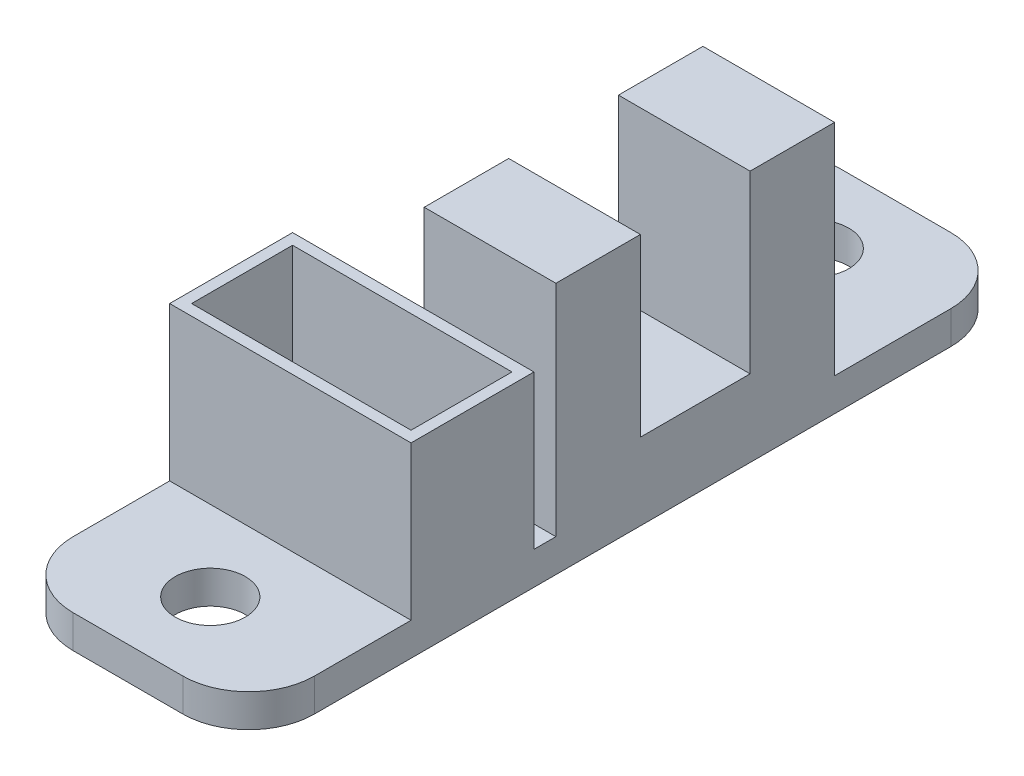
from build123d import *

# Parameters (mm, degrees)
SKETCH_1_W          = 11
SKETCH_1_H          = 35
EXTRUDE_1_DEPTH     = 1.5
SKETCH_2_R          = 1.6
CUT_EXTRUDE_1_DEPTH = 1.5
FILLET_1_R          = 3
SKETCH_3_W          = 6
SKETCH_3_H          = 12.7
EXTRUDE_2_DEPTH     = 10
SKETCH_4_W          = 6
SKETCH_4_H          = 5
CUT_EXTRUDE_2_DEPTH = 8
SKETCH_5_W          = 11
SKETCH_5_H          = 5.6
EXTRUDE_3_DEPTH     = 7
SKETCH_6_W          = 10
SKETCH_6_H          = 4.6
CUT_EXTRUDE_3_DEPTH = 5


with BuildPart() as part:
    # Sketch 1 → Extrude 1 (new body)
    with BuildSketch(Plane(origin=(0, 0, 0), x_dir=(1, 0, 0), z_dir=(0, 1, 0))):
        Rectangle(SKETCH_1_W, SKETCH_1_H)
    extrude(amount=EXTRUDE_1_DEPTH)

    # Sketch 2 → Cut-Extrude 1 (cut)
    with BuildSketch(Plane(origin=(0, 1.5, 0), x_dir=(1, 0, 0), z_dir=(0, 1, 0))):
        with Locations(Location((0, 13.75, 0), (0, 0, 270))):
            Circle(SKETCH_2_R)
        with Locations(Location((0, -13.75, 0), (0, 0, 90))):
            Circle(SKETCH_2_R)
    extrude(amount=-CUT_EXTRUDE_1_DEPTH, mode=Mode.SUBTRACT)

    # Fillet 1
    fillet_1_edges = [part.edges().sort_by_distance(p)[0] for p in [
        (5.5, 0.75, 17.5),
        (-5.5, 0.75, 17.5),
        (-5.5, 0.75, -17.5),
        (5.5, 0.75, -17.5),
    ]]
    fillet(fillet_1_edges, radius=FILLET_1_R)

    # Sketch 3 → Extrude 2 (add)
    with BuildSketch(Plane(origin=(0, 1.5, 0), x_dir=(1, 0, 0), z_dir=(0, 1, 0))):
        with Locations((2.5, 2.85)):
            Rectangle(SKETCH_3_W, SKETCH_3_H)
    extrude(amount=EXTRUDE_2_DEPTH)

    # Sketch 4 → Cut-Extrude 2 (cut)
    with BuildSketch(Plane(origin=(0, 11.5, 0), x_dir=(1, 0, 0), z_dir=(0, 1, 0))):
        with Locations((2.5, 2.85)):
            Rectangle(SKETCH_4_W, SKETCH_4_H)
    extrude(amount=-CUT_EXTRUDE_2_DEPTH, mode=Mode.SUBTRACT)

    # Sketch 5 → Extrude 3 (add)
    with BuildSketch(Plane(origin=(0, 1.5, 0), x_dir=(1, 0, 0), z_dir=(0, 1, 0))):
        with Locations((0, -7.3)):
            Rectangle(SKETCH_5_W, SKETCH_5_H)
    extrude(amount=EXTRUDE_3_DEPTH)

    # Sketch 6 → Cut-Extrude 3 (cut)
    with BuildSketch(Plane(origin=(0, 8.5, 0), x_dir=(1, 0, 0), z_dir=(0, 1, 0))):
        with Locations((0, -7.3)):
            Rectangle(SKETCH_6_W, SKETCH_6_H)
    extrude(amount=-CUT_EXTRUDE_3_DEPTH, mode=Mode.SUBTRACT)


solid = part.part
